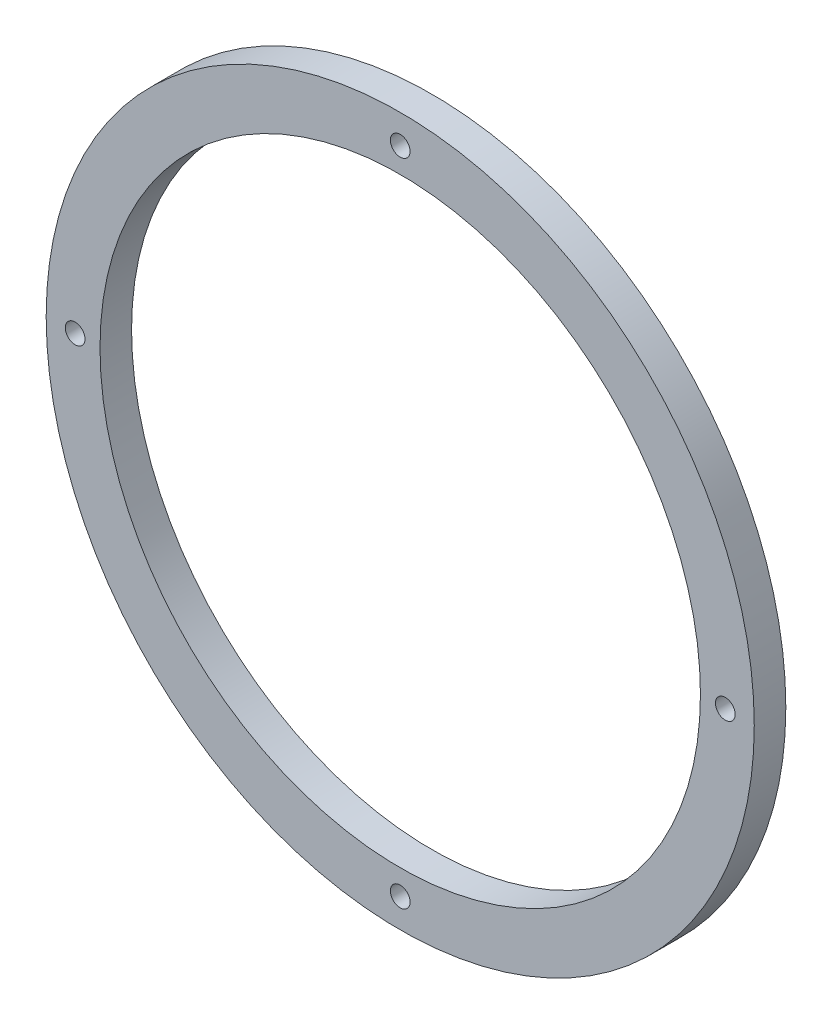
ISO-10303-21;
HEADER;
FILE_DESCRIPTION(('STEP AP214'),'2;1');
FILE_NAME('part.step','',(''),(''),'','','');
FILE_SCHEMA(('AUTOMOTIVE_DESIGN { 1 0 10303 214 1 1 1 1 }'));
ENDSEC;
DATA;
#1=APPLICATION_CONTEXT('core data for automotive mechanical design processes');
#2=APPLICATION_PROTOCOL_DEFINITION('international standard','automotive_design',2000,#1);
#3=PRODUCT_CONTEXT('',#1,'mechanical');
#4=PRODUCT('Part','Part','',(#3));
#5=PRODUCT_RELATED_PRODUCT_CATEGORY('part','',(#4));
#6=PRODUCT_DEFINITION_FORMATION('','',#4);
#7=PRODUCT_DEFINITION_CONTEXT('part definition',#1,'design');
#8=PRODUCT_DEFINITION('design','',#6,#7);
#9=PRODUCT_DEFINITION_SHAPE('','',#8);
#10=(LENGTH_UNIT() NAMED_UNIT(*) SI_UNIT(.MILLI.,.METRE.));
#11=(NAMED_UNIT(*) PLANE_ANGLE_UNIT() SI_UNIT($,.RADIAN.));
#12=(NAMED_UNIT(*) SI_UNIT($,.STERADIAN.) SOLID_ANGLE_UNIT());
#13=UNCERTAINTY_MEASURE_WITH_UNIT(LENGTH_MEASURE(1.E-05),#10,'distance_accuracy_value','');
#14=(GEOMETRIC_REPRESENTATION_CONTEXT(3) GLOBAL_UNCERTAINTY_ASSIGNED_CONTEXT((#13)) GLOBAL_UNIT_ASSIGNED_CONTEXT((#10,
#11,#12)) REPRESENTATION_CONTEXT('',''));
#15=CARTESIAN_POINT('',(0.,0.,0.));
#16=DIRECTION('',(0.,0.,1.));
#17=DIRECTION('',(1.,0.,0.));
#18=AXIS2_PLACEMENT_3D('',#15,#16,#17);
#19=CARTESIAN_POINT('',(0.,0.,7.62));
#20=DIRECTION('',(0.,0.,1.));
#21=DIRECTION('',(1.,0.,0.));
#22=AXIS2_PLACEMENT_3D('',#19,#20,#21);
#23=PLANE('',#22);
#24=CARTESIAN_POINT('',(0.,-78.5,7.62));
#25=DIRECTION('',(0.,0.,1.));
#26=DIRECTION('',(1.,0.,0.));
#27=AXIS2_PLACEMENT_3D('',#24,#25,#26);
#28=CIRCLE('',#27,2.38125);
#29=CARTESIAN_POINT('',(-2.38124999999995,-78.5,7.62));
#30=VERTEX_POINT('',#29);
#31=EDGE_CURVE('E58',#30,#30,#28,.T.);
#32=ORIENTED_EDGE('',*,*,#31,.F.);
#33=EDGE_LOOP('',(#32));
#34=FACE_BOUND('',#33,.T.);
#35=CARTESIAN_POINT('',(0.,78.5,7.62));
#36=DIRECTION('',(0.,0.,1.));
#37=DIRECTION('',(1.,0.,0.));
#38=AXIS2_PLACEMENT_3D('',#35,#36,#37);
#39=CIRCLE('',#38,2.38125);
#40=CARTESIAN_POINT('',(-2.38125,78.5,7.62));
#41=VERTEX_POINT('',#40);
#42=EDGE_CURVE('E46',#41,#41,#39,.T.);
#43=ORIENTED_EDGE('',*,*,#42,.F.);
#44=EDGE_LOOP('',(#43));
#45=FACE_BOUND('',#44,.T.);
#46=CARTESIAN_POINT('',(0.,0.,7.62));
#47=DIRECTION('',(0.,0.,1.));
#48=DIRECTION('',(1.,0.,0.));
#49=AXIS2_PLACEMENT_3D('',#46,#47,#48);
#50=CIRCLE('',#49,85.5);
#51=CARTESIAN_POINT('',(-85.5,0.,7.62));
#52=VERTEX_POINT('',#51);
#53=EDGE_CURVE('E10',#52,#52,#50,.T.);
#54=ORIENTED_EDGE('',*,*,#53,.T.);
#55=EDGE_LOOP('',(#54));
#56=FACE_BOUND('',#55,.T.);
#57=CARTESIAN_POINT('',(0.,0.,7.62));
#58=DIRECTION('',(0.,0.,1.));
#59=DIRECTION('',(1.,0.,0.));
#60=AXIS2_PLACEMENT_3D('',#57,#58,#59);
#61=CIRCLE('',#60,72.5);
#62=CARTESIAN_POINT('',(-72.5,0.,7.62));
#63=VERTEX_POINT('',#62);
#64=EDGE_CURVE('E41',#63,#63,#61,.T.);
#65=ORIENTED_EDGE('',*,*,#64,.F.);
#66=EDGE_LOOP('',(#65));
#67=FACE_BOUND('',#66,.T.);
#68=CARTESIAN_POINT('',(78.5,0.,7.62));
#69=DIRECTION('',(0.,0.,1.));
#70=DIRECTION('',(1.,0.,0.));
#71=AXIS2_PLACEMENT_3D('',#68,#69,#70);
#72=CIRCLE('',#71,2.38125000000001);
#73=CARTESIAN_POINT('',(76.11875,0.,7.62));
#74=VERTEX_POINT('',#73);
#75=EDGE_CURVE('E52',#74,#74,#72,.T.);
#76=ORIENTED_EDGE('',*,*,#75,.F.);
#77=EDGE_LOOP('',(#76));
#78=FACE_BOUND('',#77,.T.);
#79=CARTESIAN_POINT('',(-78.5,0.,7.62));
#80=DIRECTION('',(0.,0.,1.));
#81=DIRECTION('',(1.,0.,0.));
#82=AXIS2_PLACEMENT_3D('',#79,#80,#81);
#83=CIRCLE('',#82,2.38125000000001);
#84=CARTESIAN_POINT('',(-80.88125,0.,7.62));
#85=VERTEX_POINT('',#84);
#86=EDGE_CURVE('E64',#85,#85,#83,.T.);
#87=ORIENTED_EDGE('',*,*,#86,.F.);
#88=EDGE_LOOP('',(#87));
#89=FACE_BOUND('',#88,.T.);
#90=ADVANCED_FACE('F30',(#34,#45,#56,#67,#78,#89),#23,.T.);
#91=CARTESIAN_POINT('',(0.,0.,0.));
#92=DIRECTION('',(0.,0.,1.));
#93=DIRECTION('',(1.,0.,0.));
#94=AXIS2_PLACEMENT_3D('',#91,#92,#93);
#95=PLANE('',#94);
#96=CARTESIAN_POINT('',(0.,0.,0.));
#97=DIRECTION('',(0.,0.,1.));
#98=DIRECTION('',(1.,0.,0.));
#99=AXIS2_PLACEMENT_3D('',#96,#97,#98);
#100=CIRCLE('',#99,85.5);
#101=CARTESIAN_POINT('',(-85.5,0.,0.));
#102=VERTEX_POINT('',#101);
#103=EDGE_CURVE('E34',#102,#102,#100,.T.);
#104=ORIENTED_EDGE('',*,*,#103,.F.);
#105=EDGE_LOOP('',(#104));
#106=FACE_BOUND('',#105,.T.);
#107=CARTESIAN_POINT('',(0.,0.,0.));
#108=DIRECTION('',(0.,0.,1.));
#109=DIRECTION('',(1.,0.,0.));
#110=AXIS2_PLACEMENT_3D('',#107,#108,#109);
#111=CIRCLE('',#110,72.5);
#112=CARTESIAN_POINT('',(-72.5,0.,0.));
#113=VERTEX_POINT('',#112);
#114=EDGE_CURVE('E43',#113,#113,#111,.T.);
#115=ORIENTED_EDGE('',*,*,#114,.T.);
#116=EDGE_LOOP('',(#115));
#117=FACE_BOUND('',#116,.T.);
#118=CARTESIAN_POINT('',(0.,78.5,0.));
#119=DIRECTION('',(0.,0.,1.));
#120=DIRECTION('',(1.,0.,0.));
#121=AXIS2_PLACEMENT_3D('',#118,#119,#120);
#122=CIRCLE('',#121,2.38125);
#123=CARTESIAN_POINT('',(-2.38125,78.5,0.));
#124=VERTEX_POINT('',#123);
#125=EDGE_CURVE('E49',#124,#124,#122,.T.);
#126=ORIENTED_EDGE('',*,*,#125,.T.);
#127=EDGE_LOOP('',(#126));
#128=FACE_BOUND('',#127,.T.);
#129=CARTESIAN_POINT('',(78.5,0.,0.));
#130=DIRECTION('',(0.,0.,1.));
#131=DIRECTION('',(1.,0.,0.));
#132=AXIS2_PLACEMENT_3D('',#129,#130,#131);
#133=CIRCLE('',#132,2.38125000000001);
#134=CARTESIAN_POINT('',(76.11875,0.,0.));
#135=VERTEX_POINT('',#134);
#136=EDGE_CURVE('E55',#135,#135,#133,.T.);
#137=ORIENTED_EDGE('',*,*,#136,.T.);
#138=EDGE_LOOP('',(#137));
#139=FACE_BOUND('',#138,.T.);
#140=CARTESIAN_POINT('',(0.,-78.5,0.));
#141=DIRECTION('',(0.,0.,1.));
#142=DIRECTION('',(1.,0.,0.));
#143=AXIS2_PLACEMENT_3D('',#140,#141,#142);
#144=CIRCLE('',#143,2.38125);
#145=CARTESIAN_POINT('',(-2.38124999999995,-78.5,0.));
#146=VERTEX_POINT('',#145);
#147=EDGE_CURVE('E61',#146,#146,#144,.T.);
#148=ORIENTED_EDGE('',*,*,#147,.T.);
#149=EDGE_LOOP('',(#148));
#150=FACE_BOUND('',#149,.T.);
#151=CARTESIAN_POINT('',(-78.5,0.,0.));
#152=DIRECTION('',(0.,0.,1.));
#153=DIRECTION('',(1.,0.,0.));
#154=AXIS2_PLACEMENT_3D('',#151,#152,#153);
#155=CIRCLE('',#154,2.38125000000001);
#156=CARTESIAN_POINT('',(-80.88125,0.,0.));
#157=VERTEX_POINT('',#156);
#158=EDGE_CURVE('E67',#157,#157,#155,.T.);
#159=ORIENTED_EDGE('',*,*,#158,.T.);
#160=EDGE_LOOP('',(#159));
#161=FACE_BOUND('',#160,.T.);
#162=ADVANCED_FACE('F77',(#106,#117,#128,#139,#150,#161),#95,.F.);
#163=CARTESIAN_POINT('',(0.,0.,7.62));
#164=DIRECTION('',(0.,0.,-1.));
#165=DIRECTION('',(-1.,0.,0.));
#166=AXIS2_PLACEMENT_3D('',#163,#164,#165);
#167=CYLINDRICAL_SURFACE('',#166,85.5);
#168=CARTESIAN_POINT('',(-85.5,0.,7.62));
#169=CARTESIAN_POINT('',(-85.5,0.,7.540625));
#170=CARTESIAN_POINT('',(-85.5,0.,7.46125));
#171=CARTESIAN_POINT('',(-85.5,0.,7.3025));
#172=CARTESIAN_POINT('',(-85.5,0.,7.223125));
#173=CARTESIAN_POINT('',(-85.5,0.,7.064375));
#174=CARTESIAN_POINT('',(-85.5,0.,6.985));
#175=CARTESIAN_POINT('',(-85.5,0.,6.82625));
#176=CARTESIAN_POINT('',(-85.5,0.,6.746875));
#177=CARTESIAN_POINT('',(-85.5,0.,6.588125));
#178=CARTESIAN_POINT('',(-85.5,0.,6.50875));
#179=CARTESIAN_POINT('',(-85.5,0.,6.35));
#180=CARTESIAN_POINT('',(-85.5,0.,6.270625));
#181=CARTESIAN_POINT('',(-85.5,0.,6.111875));
#182=CARTESIAN_POINT('',(-85.5,0.,6.0325));
#183=CARTESIAN_POINT('',(-85.5,0.,5.87375));
#184=CARTESIAN_POINT('',(-85.5,0.,5.794375));
#185=CARTESIAN_POINT('',(-85.5,0.,5.635625));
#186=CARTESIAN_POINT('',(-85.5,0.,5.55625));
#187=CARTESIAN_POINT('',(-85.5,0.,5.3975));
#188=CARTESIAN_POINT('',(-85.5,0.,5.318125));
#189=CARTESIAN_POINT('',(-85.5,0.,5.159375));
#190=CARTESIAN_POINT('',(-85.5,0.,5.08));
#191=CARTESIAN_POINT('',(-85.5,0.,4.92125));
#192=CARTESIAN_POINT('',(-85.5,0.,4.841875));
#193=CARTESIAN_POINT('',(-85.5,0.,4.683125));
#194=CARTESIAN_POINT('',(-85.5,0.,4.60375));
#195=CARTESIAN_POINT('',(-85.5,0.,4.445));
#196=CARTESIAN_POINT('',(-85.5,0.,4.365625));
#197=CARTESIAN_POINT('',(-85.5,0.,4.206875));
#198=CARTESIAN_POINT('',(-85.5,0.,4.1275));
#199=CARTESIAN_POINT('',(-85.5,0.,3.96875));
#200=CARTESIAN_POINT('',(-85.5,0.,3.889375));
#201=CARTESIAN_POINT('',(-85.5,0.,3.730625));
#202=CARTESIAN_POINT('',(-85.5,0.,3.65125));
#203=CARTESIAN_POINT('',(-85.5,0.,3.4925));
#204=CARTESIAN_POINT('',(-85.5,0.,3.413125));
#205=CARTESIAN_POINT('',(-85.5,0.,3.254375));
#206=CARTESIAN_POINT('',(-85.5,0.,3.175));
#207=CARTESIAN_POINT('',(-85.5,0.,3.01625));
#208=CARTESIAN_POINT('',(-85.5,0.,2.936875));
#209=CARTESIAN_POINT('',(-85.5,0.,2.778125));
#210=CARTESIAN_POINT('',(-85.5,0.,2.69875));
#211=CARTESIAN_POINT('',(-85.5,0.,2.54));
#212=CARTESIAN_POINT('',(-85.5,0.,2.460625));
#213=CARTESIAN_POINT('',(-85.5,0.,2.301875));
#214=CARTESIAN_POINT('',(-85.5,0.,2.2225));
#215=CARTESIAN_POINT('',(-85.5,0.,2.06375));
#216=CARTESIAN_POINT('',(-85.5,0.,1.984375));
#217=CARTESIAN_POINT('',(-85.5,0.,1.825625));
#218=CARTESIAN_POINT('',(-85.5,0.,1.74625));
#219=CARTESIAN_POINT('',(-85.5,0.,1.5875));
#220=CARTESIAN_POINT('',(-85.5,0.,1.508125));
#221=CARTESIAN_POINT('',(-85.5,0.,1.349375));
#222=CARTESIAN_POINT('',(-85.5,0.,1.27));
#223=CARTESIAN_POINT('',(-85.5,0.,1.11125));
#224=CARTESIAN_POINT('',(-85.5,0.,1.031875));
#225=CARTESIAN_POINT('',(-85.5,0.,0.873125));
#226=CARTESIAN_POINT('',(-85.5,0.,0.79375));
#227=CARTESIAN_POINT('',(-85.5,0.,0.635));
#228=CARTESIAN_POINT('',(-85.5,0.,0.555625));
#229=CARTESIAN_POINT('',(-85.5,0.,0.396875));
#230=CARTESIAN_POINT('',(-85.5,0.,0.3175));
#231=CARTESIAN_POINT('',(-85.5,0.,0.15875));
#232=CARTESIAN_POINT('',(-85.5,0.,0.0793749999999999));
#233=CARTESIAN_POINT('',(-85.5,0.,0.));
#234=B_SPLINE_CURVE_WITH_KNOTS('',3,(#168,#169,#170,#171,#172,#173,#174,#175,#176,#177,#178,
#179,#180,#181,#182,#183,#184,#185,#186,#187,#188,#189,#190,#191,#192,#193,#194,#195,#196,#197,
#198,#199,#200,#201,#202,#203,#204,#205,#206,#207,#208,#209,#210,#211,#212,#213,#214,#215,#216,
#217,#218,#219,#220,#221,#222,#223,#224,#225,#226,#227,#228,#229,#230,#231,#232,#233),
.UNSPECIFIED.,.F.,.F.,(4,2,2,2,2,2,2,2,2,2,2,2,2,2,2,2,2,2,2,2,2,2,2,2,2,2,2,2,2,2,2,2,4),(0.,
0.238125,0.476249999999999,0.714375,0.952499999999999,1.190625,1.42875,1.666875,1.905,2.143125,
2.38125,2.619375,2.8575,3.095625,3.33375,3.571875,3.81,4.048125,4.28625,4.524375,4.7625,
5.000625,5.23875,5.476875,5.715,5.953125,6.19125,6.429375,6.6675,6.905625,7.14375,7.381875,
7.62),.UNSPECIFIED.);
#235=EDGE_CURVE('BSEAM32',#52,#102,#234,.T.);
#236=ORIENTED_EDGE('',*,*,#53,.F.);
#237=ORIENTED_EDGE('',*,*,#103,.T.);
#238=ORIENTED_EDGE('',*,*,#235,.T.);
#239=ORIENTED_EDGE('',*,*,#235,.F.);
#240=EDGE_LOOP('',(#236,#238,#237,#239));
#241=FACE_BOUND('',#240,.T.);
#242=ADVANCED_FACE('F32',(#241),#167,.T.);
#243=CARTESIAN_POINT('',(0.,0.,7.62));
#244=DIRECTION('',(0.,0.,-1.));
#245=DIRECTION('',(-1.,0.,0.));
#246=AXIS2_PLACEMENT_3D('',#243,#244,#245);
#247=CYLINDRICAL_SURFACE('',#246,72.5);
#248=CARTESIAN_POINT('',(-72.5,0.,7.62));
#249=CARTESIAN_POINT('',(-72.5,0.,7.540625));
#250=CARTESIAN_POINT('',(-72.5,0.,7.46125));
#251=CARTESIAN_POINT('',(-72.5,0.,7.3025));
#252=CARTESIAN_POINT('',(-72.5,0.,7.223125));
#253=CARTESIAN_POINT('',(-72.5,0.,7.064375));
#254=CARTESIAN_POINT('',(-72.5,0.,6.985));
#255=CARTESIAN_POINT('',(-72.5,0.,6.82625));
#256=CARTESIAN_POINT('',(-72.5,0.,6.746875));
#257=CARTESIAN_POINT('',(-72.5,0.,6.588125));
#258=CARTESIAN_POINT('',(-72.5,0.,6.50875));
#259=CARTESIAN_POINT('',(-72.5,0.,6.35));
#260=CARTESIAN_POINT('',(-72.5,0.,6.270625));
#261=CARTESIAN_POINT('',(-72.5,0.,6.111875));
#262=CARTESIAN_POINT('',(-72.5,0.,6.0325));
#263=CARTESIAN_POINT('',(-72.5,0.,5.87375));
#264=CARTESIAN_POINT('',(-72.5,0.,5.794375));
#265=CARTESIAN_POINT('',(-72.5,0.,5.635625));
#266=CARTESIAN_POINT('',(-72.5,0.,5.55625));
#267=CARTESIAN_POINT('',(-72.5,0.,5.3975));
#268=CARTESIAN_POINT('',(-72.5,0.,5.318125));
#269=CARTESIAN_POINT('',(-72.5,0.,5.159375));
#270=CARTESIAN_POINT('',(-72.5,0.,5.08));
#271=CARTESIAN_POINT('',(-72.5,0.,4.92125));
#272=CARTESIAN_POINT('',(-72.5,0.,4.841875));
#273=CARTESIAN_POINT('',(-72.5,0.,4.683125));
#274=CARTESIAN_POINT('',(-72.5,0.,4.60375));
#275=CARTESIAN_POINT('',(-72.5,0.,4.445));
#276=CARTESIAN_POINT('',(-72.5,0.,4.365625));
#277=CARTESIAN_POINT('',(-72.5,0.,4.206875));
#278=CARTESIAN_POINT('',(-72.5,0.,4.1275));
#279=CARTESIAN_POINT('',(-72.5,0.,3.96875));
#280=CARTESIAN_POINT('',(-72.5,0.,3.889375));
#281=CARTESIAN_POINT('',(-72.5,0.,3.730625));
#282=CARTESIAN_POINT('',(-72.5,0.,3.65125));
#283=CARTESIAN_POINT('',(-72.5,0.,3.4925));
#284=CARTESIAN_POINT('',(-72.5,0.,3.413125));
#285=CARTESIAN_POINT('',(-72.5,0.,3.254375));
#286=CARTESIAN_POINT('',(-72.5,0.,3.175));
#287=CARTESIAN_POINT('',(-72.5,0.,3.01625));
#288=CARTESIAN_POINT('',(-72.5,0.,2.936875));
#289=CARTESIAN_POINT('',(-72.5,0.,2.778125));
#290=CARTESIAN_POINT('',(-72.5,0.,2.69875));
#291=CARTESIAN_POINT('',(-72.5,0.,2.54));
#292=CARTESIAN_POINT('',(-72.5,0.,2.460625));
#293=CARTESIAN_POINT('',(-72.5,0.,2.301875));
#294=CARTESIAN_POINT('',(-72.5,0.,2.2225));
#295=CARTESIAN_POINT('',(-72.5,0.,2.06375));
#296=CARTESIAN_POINT('',(-72.5,0.,1.984375));
#297=CARTESIAN_POINT('',(-72.5,0.,1.825625));
#298=CARTESIAN_POINT('',(-72.5,0.,1.74625));
#299=CARTESIAN_POINT('',(-72.5,0.,1.5875));
#300=CARTESIAN_POINT('',(-72.5,0.,1.508125));
#301=CARTESIAN_POINT('',(-72.5,0.,1.349375));
#302=CARTESIAN_POINT('',(-72.5,0.,1.27));
#303=CARTESIAN_POINT('',(-72.5,0.,1.11125));
#304=CARTESIAN_POINT('',(-72.5,0.,1.031875));
#305=CARTESIAN_POINT('',(-72.5,0.,0.873125));
#306=CARTESIAN_POINT('',(-72.5,0.,0.79375));
#307=CARTESIAN_POINT('',(-72.5,0.,0.635));
#308=CARTESIAN_POINT('',(-72.5,0.,0.555625));
#309=CARTESIAN_POINT('',(-72.5,0.,0.396875));
#310=CARTESIAN_POINT('',(-72.5,0.,0.3175));
#311=CARTESIAN_POINT('',(-72.5,0.,0.15875));
#312=CARTESIAN_POINT('',(-72.5,0.,0.0793749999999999));
#313=CARTESIAN_POINT('',(-72.5,0.,0.));
#314=B_SPLINE_CURVE_WITH_KNOTS('',3,(#248,#249,#250,#251,#252,#253,#254,#255,#256,#257,#258,
#259,#260,#261,#262,#263,#264,#265,#266,#267,#268,#269,#270,#271,#272,#273,#274,#275,#276,#277,
#278,#279,#280,#281,#282,#283,#284,#285,#286,#287,#288,#289,#290,#291,#292,#293,#294,#295,#296,
#297,#298,#299,#300,#301,#302,#303,#304,#305,#306,#307,#308,#309,#310,#311,#312,#313),
.UNSPECIFIED.,.F.,.F.,(4,2,2,2,2,2,2,2,2,2,2,2,2,2,2,2,2,2,2,2,2,2,2,2,2,2,2,2,2,2,2,2,4),(0.,
0.238125,0.476249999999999,0.714375,0.952499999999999,1.190625,1.42875,1.666875,1.905,2.143125,
2.38125,2.619375,2.8575,3.095625,3.33375,3.571875,3.81,4.048125,4.28625,4.524375,4.7625,
5.000625,5.23875,5.476875,5.715,5.953125,6.19125,6.429375,6.6675,6.905625,7.14375,7.381875,
7.62),.UNSPECIFIED.);
#315=EDGE_CURVE('BSEAM87',#63,#113,#314,.T.);
#316=ORIENTED_EDGE('',*,*,#64,.T.);
#317=ORIENTED_EDGE('',*,*,#114,.F.);
#318=ORIENTED_EDGE('',*,*,#315,.T.);
#319=ORIENTED_EDGE('',*,*,#315,.F.);
#320=EDGE_LOOP('',(#316,#318,#317,#319));
#321=FACE_BOUND('',#320,.T.);
#322=ADVANCED_FACE('F87',(#321),#247,.F.);
#323=CARTESIAN_POINT('',(0.,78.5,7.62));
#324=DIRECTION('',(0.,0.,-1.));
#325=DIRECTION('',(-1.,0.,0.));
#326=AXIS2_PLACEMENT_3D('',#323,#324,#325);
#327=CYLINDRICAL_SURFACE('',#326,2.38125);
#328=CARTESIAN_POINT('',(-2.38125,78.5,7.62));
#329=CARTESIAN_POINT('',(-2.38125,78.5,7.540625));
#330=CARTESIAN_POINT('',(-2.38125,78.5,7.46125));
#331=CARTESIAN_POINT('',(-2.38125,78.5,7.3025));
#332=CARTESIAN_POINT('',(-2.38125,78.5,7.223125));
#333=CARTESIAN_POINT('',(-2.38125,78.5,7.064375));
#334=CARTESIAN_POINT('',(-2.38125,78.5,6.985));
#335=CARTESIAN_POINT('',(-2.38125,78.5,6.82625));
#336=CARTESIAN_POINT('',(-2.38125,78.5,6.746875));
#337=CARTESIAN_POINT('',(-2.38125,78.5,6.588125));
#338=CARTESIAN_POINT('',(-2.38125,78.5,6.50875));
#339=CARTESIAN_POINT('',(-2.38125,78.5,6.35));
#340=CARTESIAN_POINT('',(-2.38125,78.5,6.270625));
#341=CARTESIAN_POINT('',(-2.38125,78.5,6.111875));
#342=CARTESIAN_POINT('',(-2.38125,78.5,6.0325));
#343=CARTESIAN_POINT('',(-2.38125,78.5,5.87375));
#344=CARTESIAN_POINT('',(-2.38125,78.5,5.794375));
#345=CARTESIAN_POINT('',(-2.38125,78.5,5.635625));
#346=CARTESIAN_POINT('',(-2.38125,78.5,5.55625));
#347=CARTESIAN_POINT('',(-2.38125,78.5,5.3975));
#348=CARTESIAN_POINT('',(-2.38125,78.5,5.318125));
#349=CARTESIAN_POINT('',(-2.38125,78.5,5.159375));
#350=CARTESIAN_POINT('',(-2.38125,78.5,5.08));
#351=CARTESIAN_POINT('',(-2.38125,78.5,4.92125));
#352=CARTESIAN_POINT('',(-2.38125,78.5,4.841875));
#353=CARTESIAN_POINT('',(-2.38125,78.5,4.683125));
#354=CARTESIAN_POINT('',(-2.38125,78.5,4.60375));
#355=CARTESIAN_POINT('',(-2.38125,78.5,4.445));
#356=CARTESIAN_POINT('',(-2.38125,78.5,4.365625));
#357=CARTESIAN_POINT('',(-2.38125,78.5,4.206875));
#358=CARTESIAN_POINT('',(-2.38125,78.5,4.1275));
#359=CARTESIAN_POINT('',(-2.38125,78.5,3.96875));
#360=CARTESIAN_POINT('',(-2.38125,78.5,3.889375));
#361=CARTESIAN_POINT('',(-2.38125,78.5,3.730625));
#362=CARTESIAN_POINT('',(-2.38125,78.5,3.65125));
#363=CARTESIAN_POINT('',(-2.38125,78.5,3.4925));
#364=CARTESIAN_POINT('',(-2.38125,78.5,3.413125));
#365=CARTESIAN_POINT('',(-2.38125,78.5,3.254375));
#366=CARTESIAN_POINT('',(-2.38125,78.5,3.175));
#367=CARTESIAN_POINT('',(-2.38125,78.5,3.01625));
#368=CARTESIAN_POINT('',(-2.38125,78.5,2.936875));
#369=CARTESIAN_POINT('',(-2.38125,78.5,2.778125));
#370=CARTESIAN_POINT('',(-2.38125,78.5,2.69875));
#371=CARTESIAN_POINT('',(-2.38125,78.5,2.54));
#372=CARTESIAN_POINT('',(-2.38125,78.5,2.460625));
#373=CARTESIAN_POINT('',(-2.38125,78.5,2.301875));
#374=CARTESIAN_POINT('',(-2.38125,78.5,2.2225));
#375=CARTESIAN_POINT('',(-2.38125,78.5,2.06375));
#376=CARTESIAN_POINT('',(-2.38125,78.5,1.984375));
#377=CARTESIAN_POINT('',(-2.38125,78.5,1.825625));
#378=CARTESIAN_POINT('',(-2.38125,78.5,1.74625));
#379=CARTESIAN_POINT('',(-2.38125,78.5,1.5875));
#380=CARTESIAN_POINT('',(-2.38125,78.5,1.508125));
#381=CARTESIAN_POINT('',(-2.38125,78.5,1.349375));
#382=CARTESIAN_POINT('',(-2.38125,78.5,1.27));
#383=CARTESIAN_POINT('',(-2.38125,78.5,1.11125));
#384=CARTESIAN_POINT('',(-2.38125,78.5,1.031875));
#385=CARTESIAN_POINT('',(-2.38125,78.5,0.873125));
#386=CARTESIAN_POINT('',(-2.38125,78.5,0.79375));
#387=CARTESIAN_POINT('',(-2.38125,78.5,0.635));
#388=CARTESIAN_POINT('',(-2.38125,78.5,0.555625));
#389=CARTESIAN_POINT('',(-2.38125,78.5,0.396875));
#390=CARTESIAN_POINT('',(-2.38125,78.5,0.3175));
#391=CARTESIAN_POINT('',(-2.38125,78.5,0.15875));
#392=CARTESIAN_POINT('',(-2.38125,78.5,0.0793749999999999));
#393=CARTESIAN_POINT('',(-2.38125,78.5,0.));
#394=B_SPLINE_CURVE_WITH_KNOTS('',3,(#328,#329,#330,#331,#332,#333,#334,#335,#336,#337,#338,
#339,#340,#341,#342,#343,#344,#345,#346,#347,#348,#349,#350,#351,#352,#353,#354,#355,#356,#357,
#358,#359,#360,#361,#362,#363,#364,#365,#366,#367,#368,#369,#370,#371,#372,#373,#374,#375,#376,
#377,#378,#379,#380,#381,#382,#383,#384,#385,#386,#387,#388,#389,#390,#391,#392,#393),
.UNSPECIFIED.,.F.,.F.,(4,2,2,2,2,2,2,2,2,2,2,2,2,2,2,2,2,2,2,2,2,2,2,2,2,2,2,2,2,2,2,2,4),(0.,
0.238125,0.47625,0.714375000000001,0.9525,1.190625,1.42875,1.666875,1.905,2.143125,2.38125,
2.619375,2.8575,3.095625,3.33375,3.571875,3.81,4.048125,4.28625,4.524375,4.7625,5.000625,
5.23875,5.476875,5.715,5.953125,6.19125,6.429375,6.6675,6.905625,7.14375,7.381875,7.62),.UNSPECIFIED.);
#395=EDGE_CURVE('BSEAM90',#41,#124,#394,.T.);
#396=ORIENTED_EDGE('',*,*,#42,.T.);
#397=ORIENTED_EDGE('',*,*,#125,.F.);
#398=ORIENTED_EDGE('',*,*,#395,.T.);
#399=ORIENTED_EDGE('',*,*,#395,.F.);
#400=EDGE_LOOP('',(#396,#398,#397,#399));
#401=FACE_BOUND('',#400,.T.);
#402=ADVANCED_FACE('F90',(#401),#327,.F.);
#403=CARTESIAN_POINT('',(78.5,0.,7.62));
#404=DIRECTION('',(0.,0.,-1.));
#405=DIRECTION('',(-1.,0.,0.));
#406=AXIS2_PLACEMENT_3D('',#403,#404,#405);
#407=CYLINDRICAL_SURFACE('',#406,2.38125000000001);
#408=CARTESIAN_POINT('',(76.11875,0.,7.62));
#409=CARTESIAN_POINT('',(76.11875,0.,7.540625));
#410=CARTESIAN_POINT('',(76.11875,0.,7.46125));
#411=CARTESIAN_POINT('',(76.11875,0.,7.3025));
#412=CARTESIAN_POINT('',(76.11875,0.,7.223125));
#413=CARTESIAN_POINT('',(76.11875,0.,7.064375));
#414=CARTESIAN_POINT('',(76.11875,0.,6.985));
#415=CARTESIAN_POINT('',(76.11875,0.,6.82625));
#416=CARTESIAN_POINT('',(76.11875,0.,6.746875));
#417=CARTESIAN_POINT('',(76.11875,0.,6.588125));
#418=CARTESIAN_POINT('',(76.11875,0.,6.50875));
#419=CARTESIAN_POINT('',(76.11875,0.,6.35));
#420=CARTESIAN_POINT('',(76.11875,0.,6.270625));
#421=CARTESIAN_POINT('',(76.11875,0.,6.111875));
#422=CARTESIAN_POINT('',(76.11875,0.,6.0325));
#423=CARTESIAN_POINT('',(76.11875,0.,5.87375));
#424=CARTESIAN_POINT('',(76.11875,0.,5.794375));
#425=CARTESIAN_POINT('',(76.11875,0.,5.635625));
#426=CARTESIAN_POINT('',(76.11875,0.,5.55625));
#427=CARTESIAN_POINT('',(76.11875,0.,5.3975));
#428=CARTESIAN_POINT('',(76.11875,0.,5.318125));
#429=CARTESIAN_POINT('',(76.11875,0.,5.159375));
#430=CARTESIAN_POINT('',(76.11875,0.,5.08));
#431=CARTESIAN_POINT('',(76.11875,0.,4.92125));
#432=CARTESIAN_POINT('',(76.11875,0.,4.841875));
#433=CARTESIAN_POINT('',(76.11875,0.,4.683125));
#434=CARTESIAN_POINT('',(76.11875,0.,4.60375));
#435=CARTESIAN_POINT('',(76.11875,0.,4.445));
#436=CARTESIAN_POINT('',(76.11875,0.,4.365625));
#437=CARTESIAN_POINT('',(76.11875,0.,4.206875));
#438=CARTESIAN_POINT('',(76.11875,0.,4.1275));
#439=CARTESIAN_POINT('',(76.11875,0.,3.96875));
#440=CARTESIAN_POINT('',(76.11875,0.,3.889375));
#441=CARTESIAN_POINT('',(76.11875,0.,3.730625));
#442=CARTESIAN_POINT('',(76.11875,0.,3.65125));
#443=CARTESIAN_POINT('',(76.11875,0.,3.4925));
#444=CARTESIAN_POINT('',(76.11875,0.,3.413125));
#445=CARTESIAN_POINT('',(76.11875,0.,3.254375));
#446=CARTESIAN_POINT('',(76.11875,0.,3.175));
#447=CARTESIAN_POINT('',(76.11875,0.,3.01625));
#448=CARTESIAN_POINT('',(76.11875,0.,2.936875));
#449=CARTESIAN_POINT('',(76.11875,0.,2.778125));
#450=CARTESIAN_POINT('',(76.11875,0.,2.69875));
#451=CARTESIAN_POINT('',(76.11875,0.,2.54));
#452=CARTESIAN_POINT('',(76.11875,0.,2.460625));
#453=CARTESIAN_POINT('',(76.11875,0.,2.301875));
#454=CARTESIAN_POINT('',(76.11875,0.,2.2225));
#455=CARTESIAN_POINT('',(76.11875,0.,2.06375));
#456=CARTESIAN_POINT('',(76.11875,0.,1.984375));
#457=CARTESIAN_POINT('',(76.11875,0.,1.825625));
#458=CARTESIAN_POINT('',(76.11875,0.,1.74625));
#459=CARTESIAN_POINT('',(76.11875,0.,1.5875));
#460=CARTESIAN_POINT('',(76.11875,0.,1.508125));
#461=CARTESIAN_POINT('',(76.11875,0.,1.349375));
#462=CARTESIAN_POINT('',(76.11875,0.,1.27));
#463=CARTESIAN_POINT('',(76.11875,0.,1.11125));
#464=CARTESIAN_POINT('',(76.11875,0.,1.031875));
#465=CARTESIAN_POINT('',(76.11875,0.,0.873125));
#466=CARTESIAN_POINT('',(76.11875,0.,0.79375));
#467=CARTESIAN_POINT('',(76.11875,0.,0.635));
#468=CARTESIAN_POINT('',(76.11875,0.,0.555625));
#469=CARTESIAN_POINT('',(76.11875,0.,0.396875));
#470=CARTESIAN_POINT('',(76.11875,0.,0.3175));
#471=CARTESIAN_POINT('',(76.11875,0.,0.15875));
#472=CARTESIAN_POINT('',(76.11875,0.,0.0793749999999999));
#473=CARTESIAN_POINT('',(76.11875,0.,0.));
#474=B_SPLINE_CURVE_WITH_KNOTS('',3,(#408,#409,#410,#411,#412,#413,#414,#415,#416,#417,#418,
#419,#420,#421,#422,#423,#424,#425,#426,#427,#428,#429,#430,#431,#432,#433,#434,#435,#436,#437,
#438,#439,#440,#441,#442,#443,#444,#445,#446,#447,#448,#449,#450,#451,#452,#453,#454,#455,#456,
#457,#458,#459,#460,#461,#462,#463,#464,#465,#466,#467,#468,#469,#470,#471,#472,#473),
.UNSPECIFIED.,.F.,.F.,(4,2,2,2,2,2,2,2,2,2,2,2,2,2,2,2,2,2,2,2,2,2,2,2,2,2,2,2,2,2,2,2,4),(0.,
0.238125,0.47625,0.714375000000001,0.9525,1.190625,1.42875,1.666875,1.905,2.143125,2.38125,
2.619375,2.8575,3.095625,3.33375,3.571875,3.81,4.048125,4.28625,4.524375,4.7625,5.000625,
5.23875,5.476875,5.715,5.953125,6.19125,6.429375,6.6675,6.905625,7.14375,7.381875,7.62),.UNSPECIFIED.);
#475=EDGE_CURVE('BSEAM94',#74,#135,#474,.T.);
#476=ORIENTED_EDGE('',*,*,#75,.T.);
#477=ORIENTED_EDGE('',*,*,#136,.F.);
#478=ORIENTED_EDGE('',*,*,#475,.T.);
#479=ORIENTED_EDGE('',*,*,#475,.F.);
#480=EDGE_LOOP('',(#476,#478,#477,#479));
#481=FACE_BOUND('',#480,.T.);
#482=ADVANCED_FACE('F94',(#481),#407,.F.);
#483=CARTESIAN_POINT('',(0.,-78.5,7.62));
#484=DIRECTION('',(0.,0.,-1.));
#485=DIRECTION('',(-1.,0.,0.));
#486=AXIS2_PLACEMENT_3D('',#483,#484,#485);
#487=CYLINDRICAL_SURFACE('',#486,2.38125);
#488=CARTESIAN_POINT('',(-2.38124999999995,-78.5,7.62));
#489=CARTESIAN_POINT('',(-2.38124999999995,-78.5,7.540625));
#490=CARTESIAN_POINT('',(-2.38124999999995,-78.5,7.46125));
#491=CARTESIAN_POINT('',(-2.38124999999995,-78.5,7.3025));
#492=CARTESIAN_POINT('',(-2.38124999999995,-78.5,7.223125));
#493=CARTESIAN_POINT('',(-2.38124999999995,-78.5,7.064375));
#494=CARTESIAN_POINT('',(-2.38124999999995,-78.5,6.985));
#495=CARTESIAN_POINT('',(-2.38124999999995,-78.5,6.82625));
#496=CARTESIAN_POINT('',(-2.38124999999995,-78.5,6.746875));
#497=CARTESIAN_POINT('',(-2.38124999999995,-78.5,6.588125));
#498=CARTESIAN_POINT('',(-2.38124999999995,-78.5,6.50875));
#499=CARTESIAN_POINT('',(-2.38124999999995,-78.5,6.35));
#500=CARTESIAN_POINT('',(-2.38124999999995,-78.5,6.270625));
#501=CARTESIAN_POINT('',(-2.38124999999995,-78.5,6.111875));
#502=CARTESIAN_POINT('',(-2.38124999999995,-78.5,6.0325));
#503=CARTESIAN_POINT('',(-2.38124999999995,-78.5,5.87375));
#504=CARTESIAN_POINT('',(-2.38124999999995,-78.5,5.794375));
#505=CARTESIAN_POINT('',(-2.38124999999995,-78.5,5.635625));
#506=CARTESIAN_POINT('',(-2.38124999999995,-78.5,5.55625));
#507=CARTESIAN_POINT('',(-2.38124999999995,-78.5,5.3975));
#508=CARTESIAN_POINT('',(-2.38124999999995,-78.5,5.318125));
#509=CARTESIAN_POINT('',(-2.38124999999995,-78.5,5.159375));
#510=CARTESIAN_POINT('',(-2.38124999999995,-78.5,5.08));
#511=CARTESIAN_POINT('',(-2.38124999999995,-78.5,4.92125));
#512=CARTESIAN_POINT('',(-2.38124999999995,-78.5,4.841875));
#513=CARTESIAN_POINT('',(-2.38124999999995,-78.5,4.683125));
#514=CARTESIAN_POINT('',(-2.38124999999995,-78.5,4.60375));
#515=CARTESIAN_POINT('',(-2.38124999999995,-78.5,4.445));
#516=CARTESIAN_POINT('',(-2.38124999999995,-78.5,4.365625));
#517=CARTESIAN_POINT('',(-2.38124999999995,-78.5,4.206875));
#518=CARTESIAN_POINT('',(-2.38124999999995,-78.5,4.1275));
#519=CARTESIAN_POINT('',(-2.38124999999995,-78.5,3.96875));
#520=CARTESIAN_POINT('',(-2.38124999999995,-78.5,3.889375));
#521=CARTESIAN_POINT('',(-2.38124999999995,-78.5,3.730625));
#522=CARTESIAN_POINT('',(-2.38124999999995,-78.5,3.65125));
#523=CARTESIAN_POINT('',(-2.38124999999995,-78.5,3.4925));
#524=CARTESIAN_POINT('',(-2.38124999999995,-78.5,3.413125));
#525=CARTESIAN_POINT('',(-2.38124999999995,-78.5,3.254375));
#526=CARTESIAN_POINT('',(-2.38124999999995,-78.5,3.175));
#527=CARTESIAN_POINT('',(-2.38124999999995,-78.5,3.01625));
#528=CARTESIAN_POINT('',(-2.38124999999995,-78.5,2.936875));
#529=CARTESIAN_POINT('',(-2.38124999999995,-78.5,2.778125));
#530=CARTESIAN_POINT('',(-2.38124999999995,-78.5,2.69875));
#531=CARTESIAN_POINT('',(-2.38124999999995,-78.5,2.54));
#532=CARTESIAN_POINT('',(-2.38124999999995,-78.5,2.460625));
#533=CARTESIAN_POINT('',(-2.38124999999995,-78.5,2.301875));
#534=CARTESIAN_POINT('',(-2.38124999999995,-78.5,2.2225));
#535=CARTESIAN_POINT('',(-2.38124999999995,-78.5,2.06375));
#536=CARTESIAN_POINT('',(-2.38124999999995,-78.5,1.984375));
#537=CARTESIAN_POINT('',(-2.38124999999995,-78.5,1.825625));
#538=CARTESIAN_POINT('',(-2.38124999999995,-78.5,1.74625));
#539=CARTESIAN_POINT('',(-2.38124999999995,-78.5,1.5875));
#540=CARTESIAN_POINT('',(-2.38124999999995,-78.5,1.508125));
#541=CARTESIAN_POINT('',(-2.38124999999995,-78.5,1.349375));
#542=CARTESIAN_POINT('',(-2.38124999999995,-78.5,1.27));
#543=CARTESIAN_POINT('',(-2.38124999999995,-78.5,1.11125));
#544=CARTESIAN_POINT('',(-2.38124999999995,-78.5,1.031875));
#545=CARTESIAN_POINT('',(-2.38124999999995,-78.5,0.873125));
#546=CARTESIAN_POINT('',(-2.38124999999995,-78.5,0.79375));
#547=CARTESIAN_POINT('',(-2.38124999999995,-78.5,0.635));
#548=CARTESIAN_POINT('',(-2.38124999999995,-78.5,0.555625));
#549=CARTESIAN_POINT('',(-2.38124999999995,-78.5,0.396875));
#550=CARTESIAN_POINT('',(-2.38124999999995,-78.5,0.3175));
#551=CARTESIAN_POINT('',(-2.38124999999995,-78.5,0.15875));
#552=CARTESIAN_POINT('',(-2.38124999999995,-78.5,0.0793749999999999));
#553=CARTESIAN_POINT('',(-2.38124999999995,-78.5,0.));
#554=B_SPLINE_CURVE_WITH_KNOTS('',3,(#488,#489,#490,#491,#492,#493,#494,#495,#496,#497,#498,
#499,#500,#501,#502,#503,#504,#505,#506,#507,#508,#509,#510,#511,#512,#513,#514,#515,#516,#517,
#518,#519,#520,#521,#522,#523,#524,#525,#526,#527,#528,#529,#530,#531,#532,#533,#534,#535,#536,
#537,#538,#539,#540,#541,#542,#543,#544,#545,#546,#547,#548,#549,#550,#551,#552,#553),
.UNSPECIFIED.,.F.,.F.,(4,2,2,2,2,2,2,2,2,2,2,2,2,2,2,2,2,2,2,2,2,2,2,2,2,2,2,2,2,2,2,2,4),(0.,
0.238125,0.47625,0.714375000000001,0.9525,1.190625,1.42875,1.666875,1.905,2.143125,2.38125,
2.619375,2.8575,3.095625,3.33375,3.571875,3.81,4.048125,4.28625,4.524375,4.7625,5.000625,
5.23875,5.476875,5.715,5.953125,6.19125,6.429375,6.6675,6.905625,7.14375,7.381875,7.62),.UNSPECIFIED.);
#555=EDGE_CURVE('BSEAM98',#30,#146,#554,.T.);
#556=ORIENTED_EDGE('',*,*,#31,.T.);
#557=ORIENTED_EDGE('',*,*,#147,.F.);
#558=ORIENTED_EDGE('',*,*,#555,.T.);
#559=ORIENTED_EDGE('',*,*,#555,.F.);
#560=EDGE_LOOP('',(#556,#558,#557,#559));
#561=FACE_BOUND('',#560,.T.);
#562=ADVANCED_FACE('F98',(#561),#487,.F.);
#563=CARTESIAN_POINT('',(-78.5,0.,7.62));
#564=DIRECTION('',(0.,0.,-1.));
#565=DIRECTION('',(-1.,0.,0.));
#566=AXIS2_PLACEMENT_3D('',#563,#564,#565);
#567=CYLINDRICAL_SURFACE('',#566,2.38125000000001);
#568=CARTESIAN_POINT('',(-80.88125,0.,7.62));
#569=CARTESIAN_POINT('',(-80.88125,0.,7.540625));
#570=CARTESIAN_POINT('',(-80.88125,0.,7.46125));
#571=CARTESIAN_POINT('',(-80.88125,0.,7.3025));
#572=CARTESIAN_POINT('',(-80.88125,0.,7.223125));
#573=CARTESIAN_POINT('',(-80.88125,0.,7.064375));
#574=CARTESIAN_POINT('',(-80.88125,0.,6.985));
#575=CARTESIAN_POINT('',(-80.88125,0.,6.82625));
#576=CARTESIAN_POINT('',(-80.88125,0.,6.746875));
#577=CARTESIAN_POINT('',(-80.88125,0.,6.588125));
#578=CARTESIAN_POINT('',(-80.88125,0.,6.50875));
#579=CARTESIAN_POINT('',(-80.88125,0.,6.35));
#580=CARTESIAN_POINT('',(-80.88125,0.,6.270625));
#581=CARTESIAN_POINT('',(-80.88125,0.,6.111875));
#582=CARTESIAN_POINT('',(-80.88125,0.,6.0325));
#583=CARTESIAN_POINT('',(-80.88125,0.,5.87375));
#584=CARTESIAN_POINT('',(-80.88125,0.,5.794375));
#585=CARTESIAN_POINT('',(-80.88125,0.,5.635625));
#586=CARTESIAN_POINT('',(-80.88125,0.,5.55625));
#587=CARTESIAN_POINT('',(-80.88125,0.,5.3975));
#588=CARTESIAN_POINT('',(-80.88125,0.,5.318125));
#589=CARTESIAN_POINT('',(-80.88125,0.,5.159375));
#590=CARTESIAN_POINT('',(-80.88125,0.,5.08));
#591=CARTESIAN_POINT('',(-80.88125,0.,4.92125));
#592=CARTESIAN_POINT('',(-80.88125,0.,4.841875));
#593=CARTESIAN_POINT('',(-80.88125,0.,4.683125));
#594=CARTESIAN_POINT('',(-80.88125,0.,4.60375));
#595=CARTESIAN_POINT('',(-80.88125,0.,4.445));
#596=CARTESIAN_POINT('',(-80.88125,0.,4.365625));
#597=CARTESIAN_POINT('',(-80.88125,0.,4.206875));
#598=CARTESIAN_POINT('',(-80.88125,0.,4.1275));
#599=CARTESIAN_POINT('',(-80.88125,0.,3.96875));
#600=CARTESIAN_POINT('',(-80.88125,0.,3.889375));
#601=CARTESIAN_POINT('',(-80.88125,0.,3.730625));
#602=CARTESIAN_POINT('',(-80.88125,0.,3.65125));
#603=CARTESIAN_POINT('',(-80.88125,0.,3.4925));
#604=CARTESIAN_POINT('',(-80.88125,0.,3.413125));
#605=CARTESIAN_POINT('',(-80.88125,0.,3.254375));
#606=CARTESIAN_POINT('',(-80.88125,0.,3.175));
#607=CARTESIAN_POINT('',(-80.88125,0.,3.01625));
#608=CARTESIAN_POINT('',(-80.88125,0.,2.936875));
#609=CARTESIAN_POINT('',(-80.88125,0.,2.778125));
#610=CARTESIAN_POINT('',(-80.88125,0.,2.69875));
#611=CARTESIAN_POINT('',(-80.88125,0.,2.54));
#612=CARTESIAN_POINT('',(-80.88125,0.,2.460625));
#613=CARTESIAN_POINT('',(-80.88125,0.,2.301875));
#614=CARTESIAN_POINT('',(-80.88125,0.,2.2225));
#615=CARTESIAN_POINT('',(-80.88125,0.,2.06375));
#616=CARTESIAN_POINT('',(-80.88125,0.,1.984375));
#617=CARTESIAN_POINT('',(-80.88125,0.,1.825625));
#618=CARTESIAN_POINT('',(-80.88125,0.,1.74625));
#619=CARTESIAN_POINT('',(-80.88125,0.,1.5875));
#620=CARTESIAN_POINT('',(-80.88125,0.,1.508125));
#621=CARTESIAN_POINT('',(-80.88125,0.,1.349375));
#622=CARTESIAN_POINT('',(-80.88125,0.,1.27));
#623=CARTESIAN_POINT('',(-80.88125,0.,1.11125));
#624=CARTESIAN_POINT('',(-80.88125,0.,1.031875));
#625=CARTESIAN_POINT('',(-80.88125,0.,0.873125));
#626=CARTESIAN_POINT('',(-80.88125,0.,0.79375));
#627=CARTESIAN_POINT('',(-80.88125,0.,0.635));
#628=CARTESIAN_POINT('',(-80.88125,0.,0.555625));
#629=CARTESIAN_POINT('',(-80.88125,0.,0.396875));
#630=CARTESIAN_POINT('',(-80.88125,0.,0.3175));
#631=CARTESIAN_POINT('',(-80.88125,0.,0.15875));
#632=CARTESIAN_POINT('',(-80.88125,0.,0.0793749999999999));
#633=CARTESIAN_POINT('',(-80.88125,0.,0.));
#634=B_SPLINE_CURVE_WITH_KNOTS('',3,(#568,#569,#570,#571,#572,#573,#574,#575,#576,#577,#578,
#579,#580,#581,#582,#583,#584,#585,#586,#587,#588,#589,#590,#591,#592,#593,#594,#595,#596,#597,
#598,#599,#600,#601,#602,#603,#604,#605,#606,#607,#608,#609,#610,#611,#612,#613,#614,#615,#616,
#617,#618,#619,#620,#621,#622,#623,#624,#625,#626,#627,#628,#629,#630,#631,#632,#633),
.UNSPECIFIED.,.F.,.F.,(4,2,2,2,2,2,2,2,2,2,2,2,2,2,2,2,2,2,2,2,2,2,2,2,2,2,2,2,2,2,2,2,4),(0.,
0.238125,0.47625,0.714375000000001,0.9525,1.190625,1.42875,1.666875,1.905,2.143125,2.38125,
2.619375,2.8575,3.095625,3.33375,3.571875,3.81,4.048125,4.28625,4.524375,4.7625,5.000625,
5.23875,5.476875,5.715,5.953125,6.19125,6.429375,6.6675,6.905625,7.14375,7.381875,7.62),.UNSPECIFIED.);
#635=EDGE_CURVE('BSEAM73',#85,#157,#634,.T.);
#636=ORIENTED_EDGE('',*,*,#86,.T.);
#637=ORIENTED_EDGE('',*,*,#158,.F.);
#638=ORIENTED_EDGE('',*,*,#635,.T.);
#639=ORIENTED_EDGE('',*,*,#635,.F.);
#640=EDGE_LOOP('',(#636,#638,#637,#639));
#641=FACE_BOUND('',#640,.T.);
#642=ADVANCED_FACE('F73',(#641),#567,.F.);
#643=CLOSED_SHELL('',(#90,#162,#242,#322,#402,#482,#562,#642));
#644=MANIFOLD_SOLID_BREP('B2',#643);
#645=ADVANCED_BREP_SHAPE_REPRESENTATION('',(#18,#644),#14);
#646=SHAPE_DEFINITION_REPRESENTATION(#9,#645);
ENDSEC;
END-ISO-10303-21;
